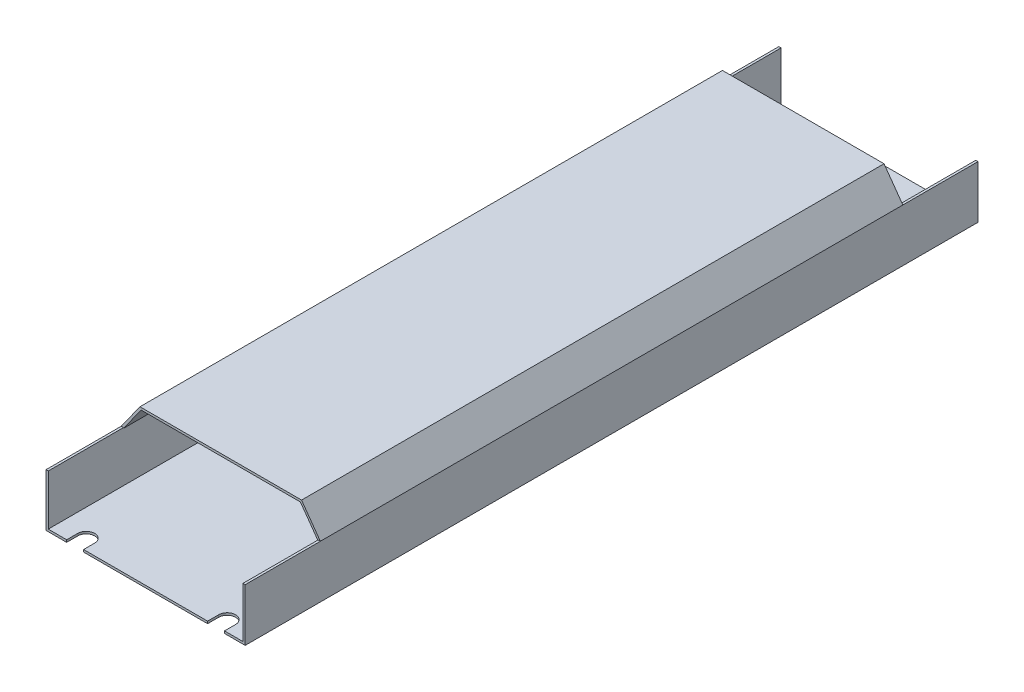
from build123d import *

# Parameters (mm, degrees)
EXTRU_MINCE1_DEPTH      = 97.5
ENL_V_MAT_EXTRU_1_REACH = 104.002
EXTRU_MINCE2_DEPTH      = 77.5


with BuildPart() as part:
    # Esquisse3 → Extru.-Mince1 (new, symmetric)
    with BuildSketch(Plane.XY):
        Polygon((-26.5, 14), (-26.5, 0), (26.5, 0), (26.5, 14), (25.9, 14), (25.9, 0.6), (-25.9, 0.6), (-25.9, 14), align=None)
    extrude(amount=EXTRU_MINCE1_DEPTH, both=True)

    # Esquisse4 → Enl_v. mat.-Extru.1 (cut, up to next)
    with BuildSketch(Plane.XZ, mode=Mode.PRIVATE) as enl_v_mat_extru_1_sk1:
        with BuildLine():
            Line((21, 100.45), (21, 94.55))
            ThreePointArc((21, 94.55), (18.75, 92.3), (16.5, 94.55))
            Line((16.5, 94.55), (16.5, 100.45))
            ThreePointArc((16.5, 100.45), (18.75, 102.7), (21, 100.45))
        make_face()
    enl_v_mat_extru_1_tool1 = extrude(enl_v_mat_extru_1_sk1.sketch, amount=-ENL_V_MAT_EXTRU_1_REACH, mode=Mode.PRIVATE) & part.part
    # Esquisse4 → Enl_v. mat.-Extru.1 (cut, up to next)
    with BuildSketch(Plane.XZ, mode=Mode.PRIVATE) as enl_v_mat_extru_1_sk2:
        with BuildLine():
            Line((-21, 100.45), (-21, 94.55))
            ThreePointArc((-21, 94.55), (-18.75, 92.3), (-16.5, 94.55))
            Line((-16.5, 94.55), (-16.5, 100.45))
            ThreePointArc((-16.5, 100.45), (-18.75, 102.7), (-21, 100.45))
        make_face()
    enl_v_mat_extru_1_tool2 = extrude(enl_v_mat_extru_1_sk2.sketch, amount=-ENL_V_MAT_EXTRU_1_REACH, mode=Mode.PRIVATE) & part.part
    enl_v_mat_extru_1_1 = enl_v_mat_extru_1_tool1.solids().sort_by_distance((18.75, 0, 97.5))[0]
    add(enl_v_mat_extru_1_1, mode=Mode.SUBTRACT)
    enl_v_mat_extru_1_2 = enl_v_mat_extru_1_tool2.solids().sort_by_distance((-18.75, 0, 97.5))[0]
    add(enl_v_mat_extru_1_2, mode=Mode.SUBTRACT)
    enl_v_mat_extru_1 = enl_v_mat_extru_1_1 + enl_v_mat_extru_1_2  # Enl_v. mat.-Extru.1 as one shape, for the pattern or mirror that repeats it

    # Sym_trie1: Enl_v. mat.-Extru.1 across plane
    add(enl_v_mat_extru_1.mirror(Plane.XY), mode=Mode.SUBTRACT)

    # Esquisse5 → Extru.-Mince2 (add, symmetric)
    with BuildSketch(Plane.XY):
        Polygon((-26.5, 14), (-21.5, 21), (21.5, 21), (26.5, 14), (26.011759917, 13.651257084), (21.191229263, 20.4), (-21.191229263, 20.4), (-26.011759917, 13.651257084), align=None)
    extrude(amount=EXTRU_MINCE2_DEPTH, both=True)


solid = part.part
